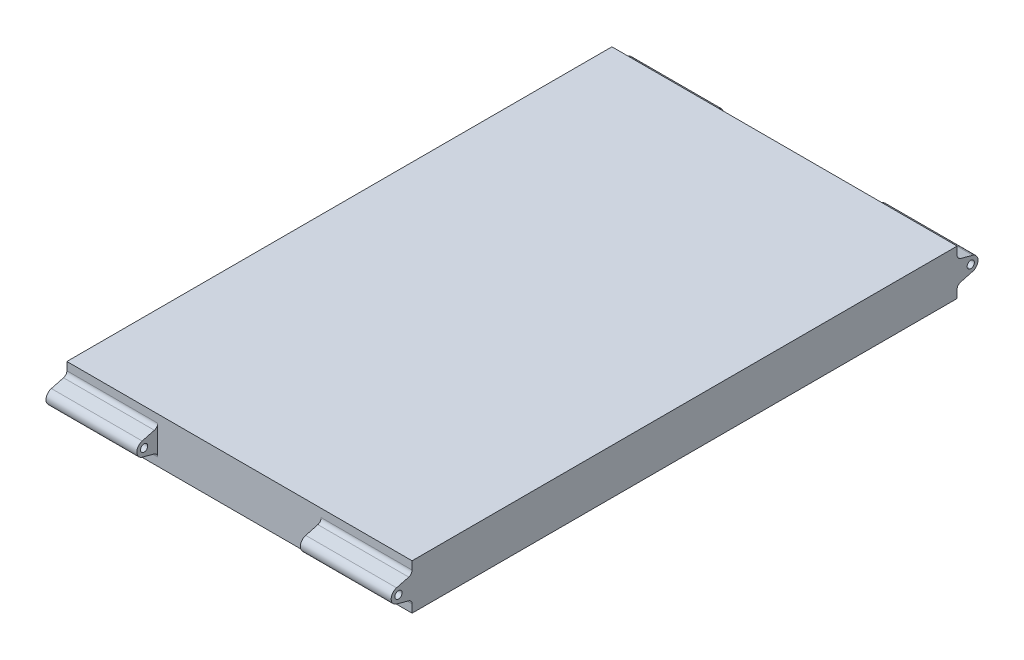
from build123d import *

# Parameters (mm, degrees)
SKETCH1_W               = 380
SKETCH1_H               = 600
BOSS_EXTRUDE1_DEPTH     = 10
SKETCH1_2_W             = 380
SKETCH1_2_H             = 600
SKETCH1_2_W_2           = 360
SKETCH1_2_H_2           = 580
EXTRUDE_THIN1_DEPTH     = 40
SKETCH2_R               = 4
BOSS_EXTRUDE3_DEPTH     = 100
MIRROR1_COPY_1_SKETCH_R = 4
MIRROR1_COPY_1_DEPTH    = 100
FILLET1_R               = 5


with BuildPart() as part:
    # Sketch1 → Boss-Extrude1 (new body)
    with BuildSketch(Plane(origin=(0, 0, 0), x_dir=(1, 0, 0), z_dir=(0, 1, 0))):
        Rectangle(SKETCH1_W, SKETCH1_H)
    extrude(amount=BOSS_EXTRUDE1_DEPTH)

    # Sketch1_2 → Extrude-Thin1 (add)
    with BuildSketch(Plane(origin=(0, 0, 0), x_dir=(1, 0, 0), z_dir=(0, 1, 0))):
        Rectangle(SKETCH1_2_W, SKETCH1_2_H)
        Rectangle(SKETCH1_2_W_2, SKETCH1_2_H_2, mode=Mode.SUBTRACT)
    extrude(amount=-EXTRUDE_THIN1_DEPTH)

    # Sketch2 → Boss-Extrude3 (add)
    with BuildSketch(Plane(origin=(190, 0, 0), x_dir=(0, 0, -1), z_dir=(1, 0, 0))):
        with BuildLine():
            Line((-317.070552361, -7.27259339), (-300, -2.69855267))
            Line((-300, -2.69855267), (-300, -27.30144733))
            Line((-300, -27.30144733), (-317.070552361, -22.72740661))
            ThreePointArc((-317.070552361, -22.72740661), (-323, -15), (-317.070552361, -7.27259339))
        make_face()
        with Locations(Location((-315, -15, 0), (0, 0, 180))):
            Circle(SKETCH2_R, mode=Mode.SUBTRACT)
    boss_extrude3 = extrude(amount=-BOSS_EXTRUDE3_DEPTH)

    # Mirror5: Boss-Extrude3 across plane
    add(boss_extrude3.mirror(Plane.XY))

    # Mirror1: Boss-Extrude3 across plane
    add(boss_extrude3.mirror(Plane(origin=(0, 0, 0), x_dir=(0, 0, 1), z_dir=(1, 0, 0))))

    # Mirror1 copy 1 sketch → Mirror1 copy 1 (add)
    with BuildSketch(Plane.ZY.offset(190)):
        with BuildLine():
            Line((-317.070552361, -7.27259339), (-300, -2.69855267))
            Line((-300, -2.69855267), (-300, -27.30144733))
            Line((-300, -27.30144733), (-317.070552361, -22.72740661))
            ThreePointArc((-317.070552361, -22.72740661), (-323, -15), (-317.070552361, -7.27259339))
        make_face()
        with Locations(Location((-315, -15, 0), (0, 0, 180))):
            Circle(MIRROR1_COPY_1_SKETCH_R, mode=Mode.SUBTRACT)
    extrude(amount=-MIRROR1_COPY_1_DEPTH)

    # Fillet1
    fillet1_edges = [part.edges().sort_by_distance(p)[0] for p in [
        (140, -27.30144733, 300),
        (-140, -27.30144733, 300),
        (140, -27.30144733, -300),
        (-140, -27.30144733, -300),
        (-140, -2.69855267, -300),
        (140, -2.69855267, -300),
        (-140, -2.69855267, 300),
        (140, -2.69855267, 300),
    ]]
    fillet(fillet1_edges, radius=FILLET1_R)


solid = part.part
